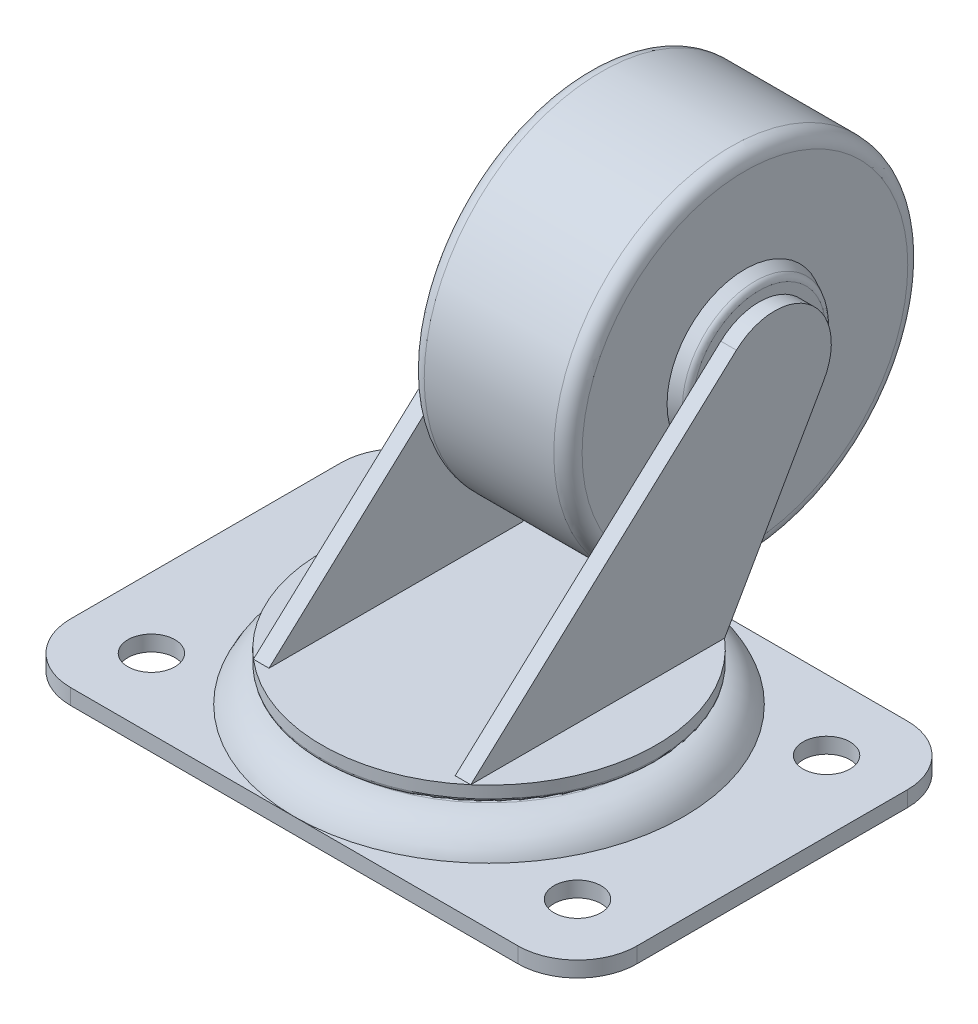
from build123d import *

# Parameters (mm, degrees)
SKETCH1_R               = 4.2164
MOUNTING_PLATE_MP_DEPTH = 2.794
WHEEL_SUPPORT_1_DEPTH   = 2.794
FILLET1_R               = 2.54
FILLET2_R               = 0.635


with BuildPart() as part:
    # Sketch1 → Mounting Plate _MP (new body)
    with BuildSketch(Plane(origin=(0, 0, 0), x_dir=(1, 0, 0), z_dir=(0, 1, 0))):
        with BuildLine():
            Line((-40.132, 34.925), (40.132, 34.925))
            ThreePointArc((40.132, 34.925), (47.675415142, 31.800415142), (50.8, 24.257))
            Line((50.8, 24.257), (50.8, -24.257))
            ThreePointArc((50.8, -24.257), (47.675415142, -31.800415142), (40.132, -34.925))
            Line((40.132, -34.925), (-40.132, -34.925))
            ThreePointArc((-40.132, -34.925), (-47.675415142, -31.800415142), (-50.8, -24.257))
            Line((-50.8, -24.257), (-50.8, 24.257))
            ThreePointArc((-50.8, 24.257), (-47.675415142, 31.800415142), (-40.132, 34.925))
        make_face()
        with Locations(Location((38.2143, 22.3393, 0), (0, 0, 270))):
            Circle(SKETCH1_R, mode=Mode.SUBTRACT)
        with Locations(Location((-38.2143, 22.3393, 0), (0, 0, 270))):
            Circle(SKETCH1_R, mode=Mode.SUBTRACT)
        with Locations(Location((-38.2143, -22.3393, 0), (0, 0, 270))):
            Circle(SKETCH1_R, mode=Mode.SUBTRACT)
        with Locations(Location((38.2143, -22.3393, 0), (0, 0, 270))):
            Circle(SKETCH1_R, mode=Mode.SUBTRACT)
    extrude(amount=MOUNTING_PLATE_MP_DEPTH)

    # Sketch2 → MP Bearing Retainer (revolve)
    with BuildSketch(Plane.XY, mode=Mode.PRIVATE) as mp_bearing_retainer_sk:
        with BuildLine():
            Line((0, 7.366), (-28.109464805, 7.366))
            ThreePointArc((-28.109464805, 7.366), (-32.212960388, 6.117130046), (-34.925, 2.794))
            Line((-34.925, 2.794), (0, 2.794))
            Line((0, 2.794), (0, 7.366))
        make_face()
    revolve(mp_bearing_retainer_sk.sketch.rotate(Axis((0, 2.794, 0), (0, 1, 0)), 270), axis=Axis((0, 2.794, 0), (0, 1, 0)))

    # Sketch3 → Caster Wheel Base (revolve)
    with BuildSketch(Plane.XY):
        Polygon((0, 7.366), (-6.35, 7.366), (-6.35, 8.636), (-29.972, 8.636), (-29.972, 11.43), (0, 11.43), align=None)
    revolve(axis=Axis((0, 11.43, 0), (0, -1, 0)))

    # Sketch7 → Wheel Support 1 (add)
    with BuildSketch(Plane.ZY.offset(-19.4945)):
        with BuildLine():
            Line((-24.884223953, 55.114106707), (22.765879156, 11.43))
            Line((22.765879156, 11.43), (-22.765879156, 11.43))
            Line((-22.765879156, 11.43), (-40.570977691, 42.583576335))
            ThreePointArc((-40.570977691, 42.583576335), (-38.091076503, 55.563283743), (-24.884223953, 55.114106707))
        make_face()
    wheel_support_1 = extrude(amount=WHEEL_SUPPORT_1_DEPTH)

    # Wheel Support 2: Wheel Support 1 across plane
    add(wheel_support_1.mirror(Plane.ZY))

    # Sketch9 → Revolve3 (revolve)
    with BuildSketch(Plane(origin=(0, 47.625, 0), x_dir=(1, 0, 0), z_dir=(0, 1, 0)), mode=Mode.PRIVATE) as revolve3_sk:
        with BuildLine():
            Line((-16.7005, 31.75), (16.7005, 31.75))
            Line((16.7005, 31.75), (16.7005, 43.665096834))
            ThreePointArc((16.7005, 43.665096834), (16.510826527, 44.332775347), (15.998461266, 44.801019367))
            Line((15.998461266, 44.801019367), (14.1605, 45.72))
            Line((14.1605, 45.72), (14.1605, 63.5))
            Line((14.1605, 63.5), (-14.1605, 63.5))
            Line((-14.1605, 63.5), (-14.1605, 45.72))
            Line((-14.1605, 45.72), (-15.998461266, 44.801019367))
            ThreePointArc((-15.998461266, 44.801019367), (-16.510826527, 44.332775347), (-16.7005, 43.665096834))
            Line((-16.7005, 43.665096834), (-16.7005, 31.75))
        make_face()
    revolve(revolve3_sk.sketch.rotate(Axis((-16.7005, 47.625, -31.75), (1, 0, 0)), 180), axis=Axis((-16.7005, 47.625, -31.75), (1, 0, 0)))

    # Fillet1
    fillet1_edges = [part.edges().sort_by_distance(p)[0] for p in [
        (14.1605, 47.625, -63.5),
        (-14.1605, 47.625, -63.5),
    ]]
    fillet(fillet1_edges, radius=FILLET1_R)

    # Fillet2
    fillet2_edges = [part.edges().sort_by_distance(p)[0] for p in [
        (29.972, 8.636, 0),
    ]]
    fillet(fillet2_edges, radius=FILLET2_R)


solid = part.part
